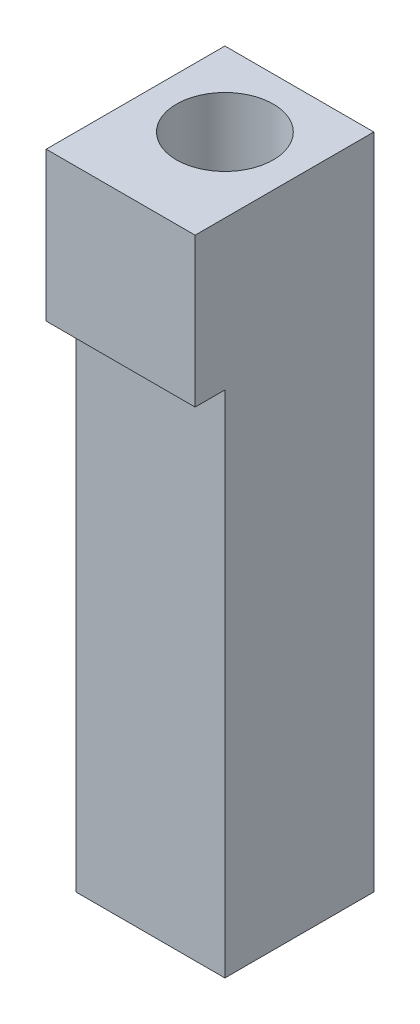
from build123d import *

# Parameters (mm, degrees)
SKETCH_1_W          = 10
SKETCH_1_H          = 44.2
EXTRUDE_1_DEPTH     = 12
SKETCH_2_OUTSIDE_W  = 23.376
SKETCH_2_OUTSIDE_H  = 55.576
CUT_EXTRUDE_1_DEPTH = 47.878993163
SKETCH_3_R          = 3.25
CUT_EXTRUDE_2_DEPTH = 5


with BuildPart() as part:
    # Sketch 1 → Extrude 1 (new body)
    with BuildSketch(Plane.XY):
        with Locations((5, 22.1)):
            Rectangle(SKETCH_1_W, SKETCH_1_H)
    extrude(amount=EXTRUDE_1_DEPTH)

    # Sketch 2 outside → Cut-Extrude 1 (cut, through all)
    with BuildSketch(Plane(origin=(10, 0, 0), x_dir=(0, 0, -1), z_dir=(1, 0, 0))):
        with Locations((-6, 22.1)):
            Rectangle(SKETCH_2_OUTSIDE_W, SKETCH_2_OUTSIDE_H)
        Polygon((-12, 34.2), (-12, 44.2), (0, 44.2), (0, 0), (-10, 0), (-10, 34.2), align=None, mode=Mode.SUBTRACT)
    extrude(amount=-CUT_EXTRUDE_1_DEPTH, mode=Mode.SUBTRACT)

    # Sketch 3 → Cut-Extrude 2 (cut)
    with BuildSketch(Plane(origin=(0, 44.2, 0), x_dir=(1, 0, 0), z_dir=(0, 1, 0))):
        with Locations(Location((5, -5, 0), (0, 0, 270))):
            Circle(SKETCH_3_R)
    extrude(amount=-CUT_EXTRUDE_2_DEPTH, mode=Mode.SUBTRACT)


solid = part.part
